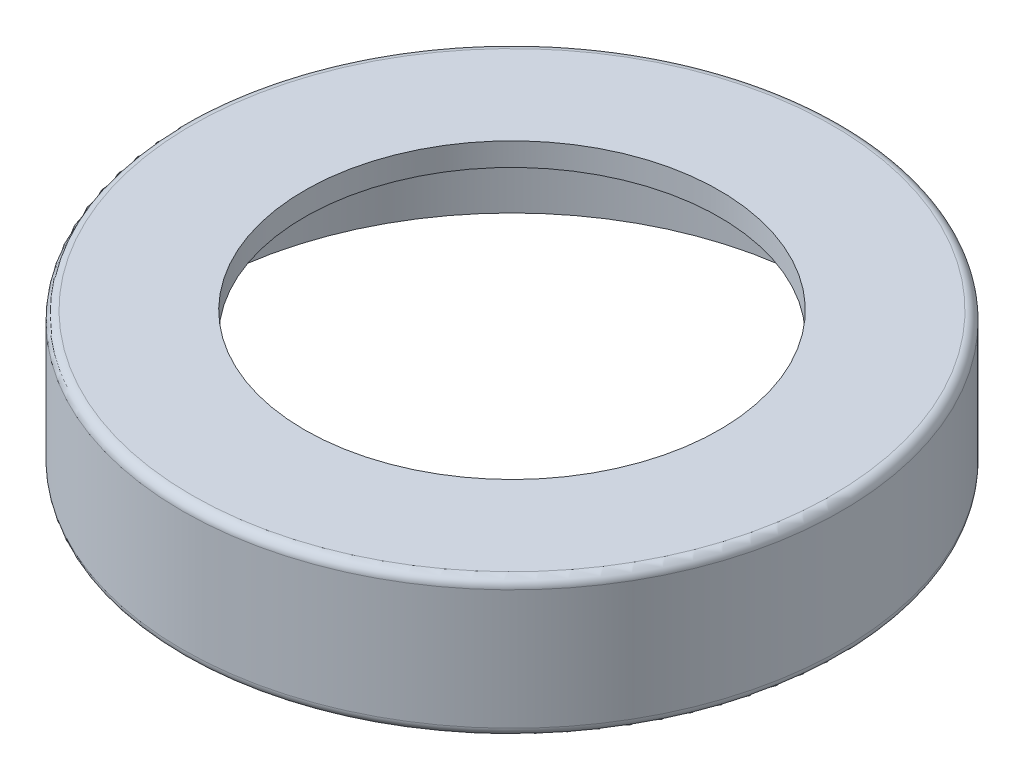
from build123d import *


with BuildPart() as part:
    # Skizze1 → Rotation1 (revolve)
    with BuildSketch(Plane.XY, mode=Mode.PRIVATE) as rotation1_sk:
        with BuildLine():
            Line((4.5, 3), (4.5, 2.5))
            Line((4.5, 2.5), (6.825, 2.5))
            Line((6.825, 2.5), (6.825, 0))
            Line((6.825, 0), (6.95, 0))
            ThreePointArc((6.95, 0), (7.091421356, 0.058578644), (7.15, 0.2))
            Line((7.15, 0.2), (7.15, 2.8))
            ThreePointArc((7.15, 2.8), (7.091421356, 2.941421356), (6.95, 3))
            Line((6.95, 3), (4.5, 3))
        make_face()
    revolve(rotation1_sk.sketch.rotate(Axis((0, 0, 0), (0, 1, 0)), 270), axis=Axis((0, 0, 0), (0, 1, 0)))


solid = part.part
